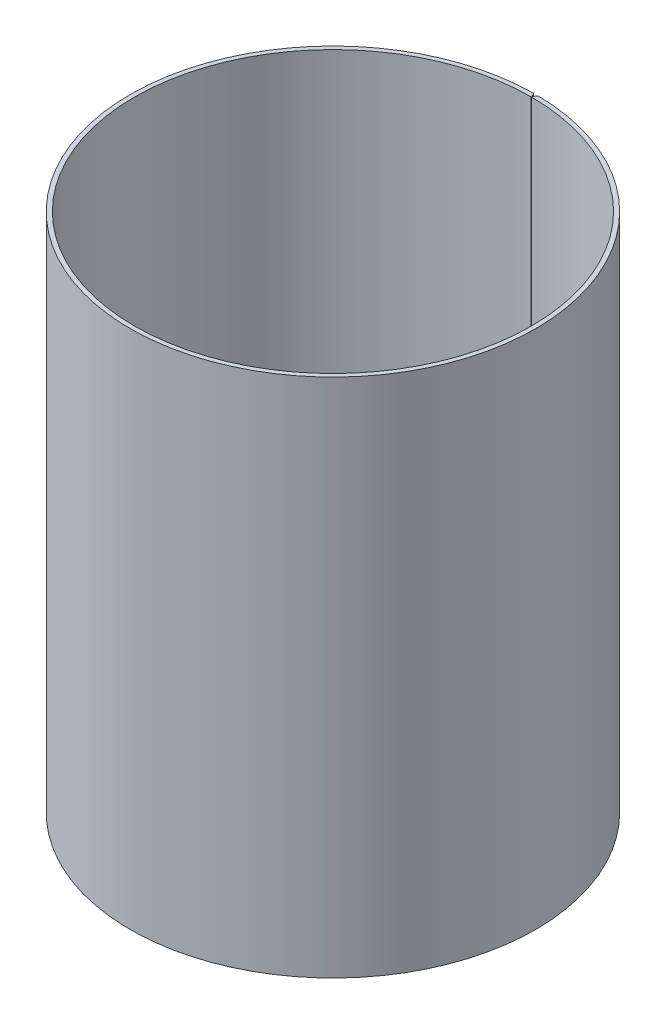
from build123d import *

# Parameters (mm, degrees)
SKETCH1_R               = 296.8625
SKETCH1_R_2             = 290.5125
EXTRUDE1_DEPTH          = 762
CUT_EXTRUDE1_DEPTH      = 870.999245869
CUT_EXTRUDE1_DEPTH_BACK = 870.999245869
SKETCH3_W               = 0.381
SKETCH3_H               = 6.35
CUT_EXTRUDE2_DEPTH      = 870.999245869


with BuildPart() as part:
    # Sketch1 → Extrude1 (new body)
    with BuildSketch(Plane(origin=(0, 0, 0), x_dir=(1, 0, 0), z_dir=(0, 1, 0))):
        with Locations(Location((0, 0, 0), (0, 0, 270))):
            Circle(SKETCH1_R)
        with Locations(Location((0, 0, 0), (0, 0, 270))):
            Circle(SKETCH1_R_2, mode=Mode.SUBTRACT)
    extrude(amount=-EXTRUDE1_DEPTH)

    # Sketch2 → Cut-Extrude1 (cut, two sides: drawn at the far end of the back side and taken through both)
    with BuildSketch(Plane(origin=(0, 0, 0), x_dir=(-1, 0, 0), z_dir=(0, 1, 0)).offset(-CUT_EXTRUDE1_DEPTH_BACK)):
        Polygon((678.095441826, -1465.782957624), (4.7625, -299.536091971), (0, -291.2872), (-4.7625, -299.536091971), (-678.095441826, -1465.782957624), (-678.095441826, -4159.114724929), (678.095441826, -4159.114724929), align=None)
    extrude(amount=CUT_EXTRUDE1_DEPTH + CUT_EXTRUDE1_DEPTH_BACK, mode=Mode.SUBTRACT)

    # Sketch3 → Cut-Extrude2 (cut, through all)
    with BuildSketch(Plane(origin=(0, 0, 0), x_dir=(-1, 0, 0), z_dir=(0, 1, 0))):
        with Locations((0, -292.1)):
            Rectangle(SKETCH3_W, SKETCH3_H)
    extrude(amount=-CUT_EXTRUDE2_DEPTH, mode=Mode.SUBTRACT)


solid = part.part
